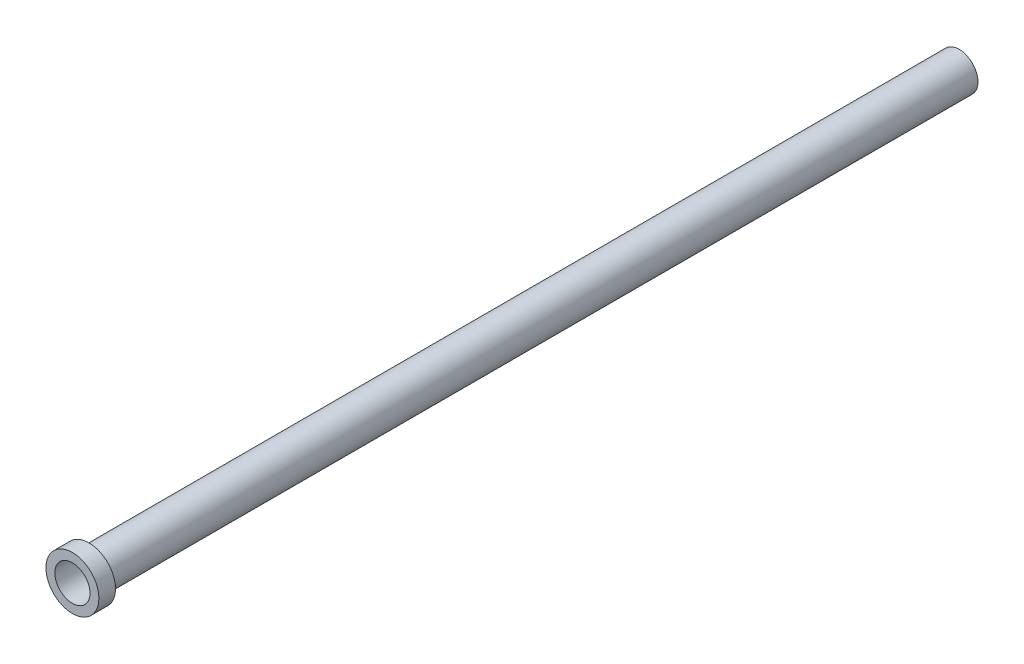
from build123d import *

# Parameters (mm, degrees)
SKETCH1_R           = 26.9875
SKETCH1_R_2         = 25.2095
BOSS_EXTRUDE1_DEPTH = 1270.635
BOSS_EXTRUDE2_START = -23.8125
SKETCH2_R           = 37.9095
SKETCH2_R_2         = 25.2095
BOSS_EXTRUDE2_DEPTH = 23.8125


with BuildPart() as part:
    # Sketch1 → Boss-Extrude1 (new body)
    with BuildSketch(Plane.XY):
        Circle(SKETCH1_R)
        Circle(SKETCH1_R_2, mode=Mode.SUBTRACT)
    extrude(amount=BOSS_EXTRUDE1_DEPTH)

    # Sketch2 → Boss-Extrude2 (add)
    with BuildSketch(Plane.XY.offset(1270.635).offset(BOSS_EXTRUDE2_START)):
        Circle(SKETCH2_R)
        Circle(SKETCH2_R_2, mode=Mode.SUBTRACT)
    extrude(amount=BOSS_EXTRUDE2_DEPTH)


solid = part.part
